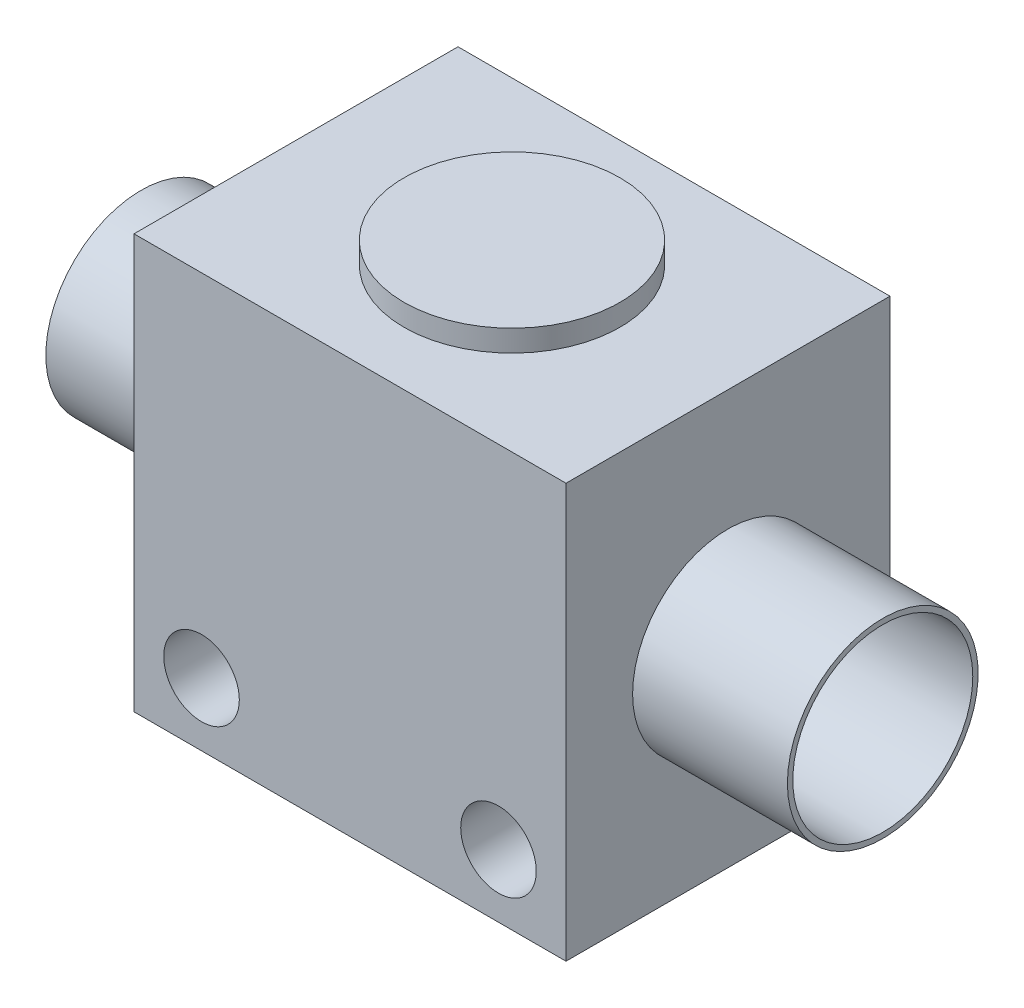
from build123d import *

# Parameters (mm, degrees)
BASE_SKETCH_W               = 24
BASE_SKETCH_H               = 23
BASE_DEPTH                  = 9
A_PORT_BOSS_SKETCH_R        = 5.3
A_PORT_BOSS_DEPTH           = 8.6
A_PORT_FITTING_CUT_SKETCH_R = 5
A_PORT_FITTING_CUT_DEPTH    = 10
P_START                     = 8.6
P_PORT_BOSS_SKETCH_R        = 5.3
P_PORT_BOSS_DEPTH           = 8.6
P_START_2                   = -10
P_PORT_FITTING_CUT_SKETCH_R = 5
P_PORT_FITTING_CUT_DEPTH    = 10
KNOB_BASE_SKETCH_R          = 6
KNOB_BASE_DEPTH             = 1.2
MOUNTING_HOLES_SKETCH_R     = 2.1
MOUNTING_HOLES_DEPTH        = 31.374331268


with BuildPart() as part:
    # Base Sketch → Base (new, symmetric)
    with BuildSketch(Plane.XY):
        with Locations((0, 0.5)):
            Rectangle(BASE_SKETCH_W, BASE_SKETCH_H)
    extrude(amount=BASE_DEPTH, both=True)

    # A Port Boss Sketch → A Port Boss (add)
    with BuildSketch(Plane(origin=(12, 0, 0), x_dir=(0, 0, -1), z_dir=(1, 0, 0))):
        with Locations(Location((0, 0, 0), (0, 0, 180))):
            Circle(A_PORT_BOSS_SKETCH_R)
    extrude(amount=A_PORT_BOSS_DEPTH)

    # A Port Fitting Cut Sketch → A Port Fitting Cut (cut)
    with BuildSketch(Plane(origin=(20.6, 0, 0), x_dir=(0, 0, -1), z_dir=(1, 0, 0))):
        Circle(A_PORT_FITTING_CUT_SKETCH_R)
    extrude(amount=-A_PORT_FITTING_CUT_DEPTH, mode=Mode.SUBTRACT)

    # P Port Boss Sketch → P Port Boss (add)
    with BuildSketch(Plane.ZY.offset(12).offset(P_START)):
        Circle(P_PORT_BOSS_SKETCH_R)
    extrude(amount=-P_PORT_BOSS_DEPTH)

    # P Port Fitting Cut Sketch → P Port Fitting Cut (cut)
    with BuildSketch(Plane.ZY.offset(20.6).offset(P_START_2)):
        with Locations(Location((0, 0, 0), (0, 0, 180))):
            Circle(P_PORT_FITTING_CUT_SKETCH_R)
    extrude(amount=P_PORT_FITTING_CUT_DEPTH, mode=Mode.SUBTRACT)

    # Knob Base Sketch → Knob Base (add)
    with BuildSketch(Plane(origin=(0, 12, 0), x_dir=(-1, 0, 0), z_dir=(0, 1, 0))):
        with Locations(Location((0, 0, 0), (0, 0, 270))):
            Circle(KNOB_BASE_SKETCH_R)
    extrude(amount=KNOB_BASE_DEPTH)

    # Mounting Holes Sketch → Mounting Holes (cut, through all)
    with BuildSketch(Plane.XY.offset(9)):
        with Locations((-8.25, -7.5)):
            Circle(MOUNTING_HOLES_SKETCH_R)
        with Locations(Location((8.25, -7.5, 0), (0, 0, 180))):
            Circle(MOUNTING_HOLES_SKETCH_R)
    extrude(amount=-MOUNTING_HOLES_DEPTH, mode=Mode.SUBTRACT)


solid = part.part
